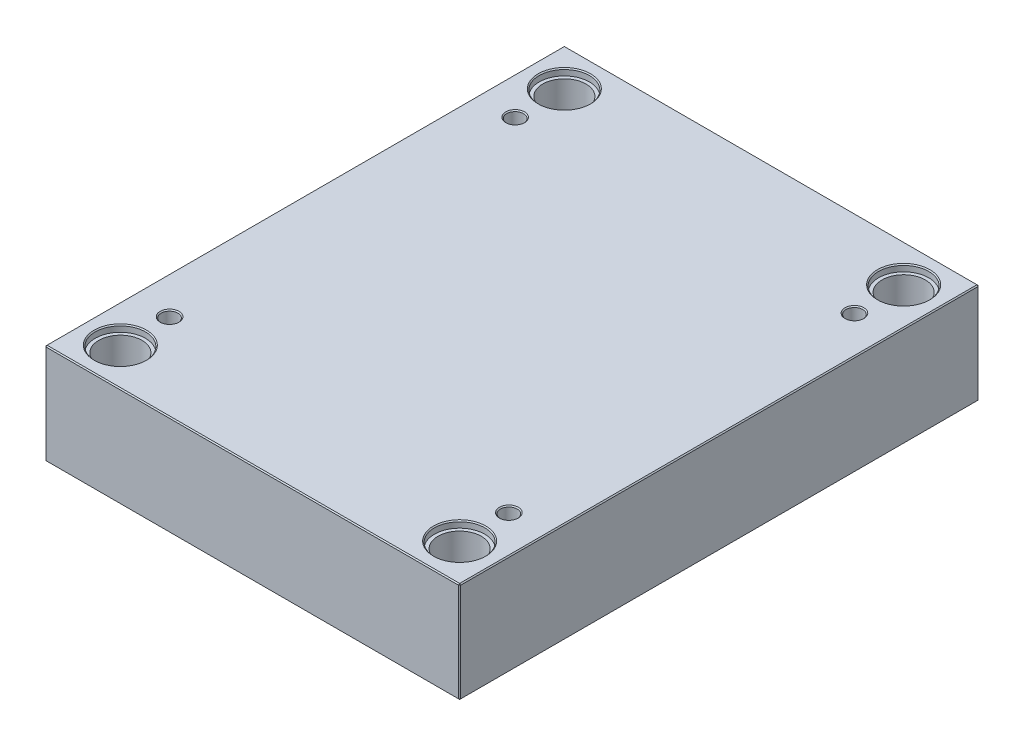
ISO-10303-21;
HEADER;
FILE_DESCRIPTION(('STEP AP214'),'2;1');
FILE_NAME('part.step','',(''),(''),'','','');
FILE_SCHEMA(('AUTOMOTIVE_DESIGN { 1 0 10303 214 1 1 1 1 }'));
ENDSEC;
DATA;
#1=APPLICATION_CONTEXT('core data for automotive mechanical design processes');
#2=APPLICATION_PROTOCOL_DEFINITION('international standard','automotive_design',2000,#1);
#3=PRODUCT_CONTEXT('',#1,'mechanical');
#4=PRODUCT('Part','Part','',(#3));
#5=PRODUCT_RELATED_PRODUCT_CATEGORY('part','',(#4));
#6=PRODUCT_DEFINITION_FORMATION('','',#4);
#7=PRODUCT_DEFINITION_CONTEXT('part definition',#1,'design');
#8=PRODUCT_DEFINITION('design','',#6,#7);
#9=PRODUCT_DEFINITION_SHAPE('','',#8);
#10=(LENGTH_UNIT() NAMED_UNIT(*) SI_UNIT(.MILLI.,.METRE.));
#11=(NAMED_UNIT(*) PLANE_ANGLE_UNIT() SI_UNIT($,.RADIAN.));
#12=(NAMED_UNIT(*) SI_UNIT($,.STERADIAN.) SOLID_ANGLE_UNIT());
#13=UNCERTAINTY_MEASURE_WITH_UNIT(LENGTH_MEASURE(1.E-05),#10,'distance_accuracy_value','');
#14=(GEOMETRIC_REPRESENTATION_CONTEXT(3) GLOBAL_UNCERTAINTY_ASSIGNED_CONTEXT((#13)) GLOBAL_UNIT_ASSIGNED_CONTEXT((#10,
#11,#12)) REPRESENTATION_CONTEXT('',''));
#15=CARTESIAN_POINT('',(0.,0.,0.));
#16=DIRECTION('',(0.,0.,1.));
#17=DIRECTION('',(1.,0.,0.));
#18=AXIS2_PLACEMENT_3D('',#15,#16,#17);
#19=CARTESIAN_POINT('',(-162.,0.,-212.));
#20=DIRECTION('',(0.,1.,0.));
#21=DIRECTION('',(0.,0.,1.));
#22=AXIS2_PLACEMENT_3D('',#19,#20,#21);
#23=CYLINDRICAL_SURFACE('',#22,20.65);
#24=CARTESIAN_POINT('',(-162.,0.999999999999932,-212.));
#25=DIRECTION('',(0.,1.,0.));
#26=DIRECTION('',(0.,0.,1.));
#27=AXIS2_PLACEMENT_3D('',#24,#25,#26);
#28=CIRCLE('',#27,20.65);
#29=CARTESIAN_POINT('',(-162.,0.999999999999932,-191.35));
#30=VERTEX_POINT('',#29);
#31=EDGE_CURVE('E472',#30,#30,#28,.F.);
#32=ORIENTED_EDGE('',*,*,#31,.T.);
#33=EDGE_LOOP('',(#32));
#34=FACE_BOUND('',#33,.T.);
#35=CARTESIAN_POINT('',(-162.,89.7,-212.));
#36=DIRECTION('',(0.,1.,0.));
#37=DIRECTION('',(0.,0.,1.));
#38=AXIS2_PLACEMENT_3D('',#35,#36,#37);
#39=CIRCLE('',#38,20.65);
#40=CARTESIAN_POINT('',(-162.,89.7,-191.35));
#41=VERTEX_POINT('',#40);
#42=EDGE_CURVE('E221',#41,#41,#39,.F.);
#43=ORIENTED_EDGE('',*,*,#42,.F.);
#44=EDGE_LOOP('',(#43));
#45=FACE_BOUND('',#44,.T.);
#46=ADVANCED_FACE('F16',(#34,#45),#23,.F.);
#47=CARTESIAN_POINT('',(162.,0.,-212.));
#48=DIRECTION('',(0.,1.,0.));
#49=DIRECTION('',(0.,0.,1.));
#50=AXIS2_PLACEMENT_3D('',#47,#48,#49);
#51=CYLINDRICAL_SURFACE('',#50,20.65);
#52=CARTESIAN_POINT('',(162.,0.999999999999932,-212.));
#53=DIRECTION('',(0.,1.,0.));
#54=DIRECTION('',(0.,0.,1.));
#55=AXIS2_PLACEMENT_3D('',#52,#53,#54);
#56=CIRCLE('',#55,20.65);
#57=CARTESIAN_POINT('',(162.,0.999999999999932,-191.35));
#58=VERTEX_POINT('',#57);
#59=EDGE_CURVE('E474',#58,#58,#56,.F.);
#60=ORIENTED_EDGE('',*,*,#59,.T.);
#61=EDGE_LOOP('',(#60));
#62=FACE_BOUND('',#61,.T.);
#63=CARTESIAN_POINT('',(162.,89.7,-212.));
#64=DIRECTION('',(0.,1.,0.));
#65=DIRECTION('',(0.,0.,1.));
#66=AXIS2_PLACEMENT_3D('',#63,#64,#65);
#67=CIRCLE('',#66,20.65);
#68=CARTESIAN_POINT('',(162.,89.7,-191.35));
#69=VERTEX_POINT('',#68);
#70=EDGE_CURVE('E218',#69,#69,#67,.F.);
#71=ORIENTED_EDGE('',*,*,#70,.F.);
#72=EDGE_LOOP('',(#71));
#73=FACE_BOUND('',#72,.T.);
#74=ADVANCED_FACE('F263',(#62,#73),#51,.F.);
#75=CARTESIAN_POINT('',(162.,0.,212.));
#76=DIRECTION('',(0.,1.,0.));
#77=DIRECTION('',(0.,0.,1.));
#78=AXIS2_PLACEMENT_3D('',#75,#76,#77);
#79=CYLINDRICAL_SURFACE('',#78,20.65);
#80=CARTESIAN_POINT('',(162.,0.999999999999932,212.));
#81=DIRECTION('',(0.,1.,0.));
#82=DIRECTION('',(0.,0.,1.));
#83=AXIS2_PLACEMENT_3D('',#80,#81,#82);
#84=CIRCLE('',#83,20.65);
#85=CARTESIAN_POINT('',(162.,0.999999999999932,232.65));
#86=VERTEX_POINT('',#85);
#87=EDGE_CURVE('E477',#86,#86,#84,.F.);
#88=ORIENTED_EDGE('',*,*,#87,.T.);
#89=EDGE_LOOP('',(#88));
#90=FACE_BOUND('',#89,.T.);
#91=CARTESIAN_POINT('',(162.,89.7,212.));
#92=DIRECTION('',(0.,1.,0.));
#93=DIRECTION('',(0.,0.,1.));
#94=AXIS2_PLACEMENT_3D('',#91,#92,#93);
#95=CIRCLE('',#94,20.65);
#96=CARTESIAN_POINT('',(162.,89.7,232.65));
#97=VERTEX_POINT('',#96);
#98=EDGE_CURVE('E214',#97,#97,#95,.F.);
#99=ORIENTED_EDGE('',*,*,#98,.F.);
#100=EDGE_LOOP('',(#99));
#101=FACE_BOUND('',#100,.T.);
#102=ADVANCED_FACE('F270',(#90,#101),#79,.F.);
#103=CARTESIAN_POINT('',(-162.,0.,212.));
#104=DIRECTION('',(0.,1.,0.));
#105=DIRECTION('',(0.,0.,1.));
#106=AXIS2_PLACEMENT_3D('',#103,#104,#105);
#107=CYLINDRICAL_SURFACE('',#106,20.65);
#108=CARTESIAN_POINT('',(-162.,0.999999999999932,212.));
#109=DIRECTION('',(0.,1.,0.));
#110=DIRECTION('',(0.,0.,1.));
#111=AXIS2_PLACEMENT_3D('',#108,#109,#110);
#112=CIRCLE('',#111,20.65);
#113=CARTESIAN_POINT('',(-162.,0.999999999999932,232.65));
#114=VERTEX_POINT('',#113);
#115=EDGE_CURVE('E480',#114,#114,#112,.F.);
#116=ORIENTED_EDGE('',*,*,#115,.T.);
#117=EDGE_LOOP('',(#116));
#118=FACE_BOUND('',#117,.T.);
#119=CARTESIAN_POINT('',(-162.,89.7,212.));
#120=DIRECTION('',(0.,1.,0.));
#121=DIRECTION('',(0.,0.,1.));
#122=AXIS2_PLACEMENT_3D('',#119,#120,#121);
#123=CIRCLE('',#122,20.65);
#124=CARTESIAN_POINT('',(-162.,89.7,232.65));
#125=VERTEX_POINT('',#124);
#126=EDGE_CURVE('E211',#125,#125,#123,.F.);
#127=ORIENTED_EDGE('',*,*,#126,.F.);
#128=EDGE_LOOP('',(#127));
#129=FACE_BOUND('',#128,.T.);
#130=ADVANCED_FACE('F277',(#118,#129),#107,.F.);
#131=CARTESIAN_POINT('',(-198.,96.,248.));
#132=DIRECTION('',(1.,0.,0.));
#133=DIRECTION('',(0.,0.,-1.));
#134=AXIS2_PLACEMENT_3D('',#131,#132,#133);
#135=PLANE('',#134);
#136=DIRECTION('',(0.,-1.,0.));
#137=VECTOR('',#136,1.);
#138=CARTESIAN_POINT('',(-198.,96.,-247.));
#139=LINE('',#138,#137);
#140=CARTESIAN_POINT('',(-198.,95.,-247.));
#141=VERTEX_POINT('',#140);
#142=CARTESIAN_POINT('',(-198.,1.,-247.));
#143=VERTEX_POINT('',#142);
#144=EDGE_CURVE('E487',#141,#143,#139,.T.);
#145=ORIENTED_EDGE('',*,*,#144,.T.);
#146=DIRECTION('',(0.,0.,1.));
#147=VECTOR('',#146,1.);
#148=CARTESIAN_POINT('',(-198.,1.,248.));
#149=LINE('',#148,#147);
#150=CARTESIAN_POINT('',(-198.,1.,247.));
#151=VERTEX_POINT('',#150);
#152=EDGE_CURVE('E490',#143,#151,#149,.T.);
#153=ORIENTED_EDGE('',*,*,#152,.T.);
#154=DIRECTION('',(0.,1.,0.));
#155=VECTOR('',#154,1.);
#156=CARTESIAN_POINT('',(-198.,96.,247.));
#157=LINE('',#156,#155);
#158=CARTESIAN_POINT('',(-198.,95.,247.));
#159=VERTEX_POINT('',#158);
#160=EDGE_CURVE('E485',#151,#159,#157,.T.);
#161=ORIENTED_EDGE('',*,*,#160,.T.);
#162=DIRECTION('',(0.,0.,-1.));
#163=VECTOR('',#162,1.);
#164=CARTESIAN_POINT('',(-198.,95.,-248.));
#165=LINE('',#164,#163);
#166=EDGE_CURVE('E483',#159,#141,#165,.T.);
#167=ORIENTED_EDGE('',*,*,#166,.T.);
#168=EDGE_LOOP('',(#145,#153,#161,#167));
#169=FACE_BOUND('',#168,.T.);
#170=ADVANCED_FACE('F298',(#169),#135,.F.);
#171=CARTESIAN_POINT('',(198.,96.,248.));
#172=DIRECTION('',(0.,0.,-1.));
#173=DIRECTION('',(-1.,0.,0.));
#174=AXIS2_PLACEMENT_3D('',#171,#172,#173);
#175=PLANE('',#174);
#176=DIRECTION('',(-1.,0.,0.));
#177=VECTOR('',#176,1.);
#178=CARTESIAN_POINT('',(-198.,95.,248.));
#179=LINE('',#178,#177);
#180=CARTESIAN_POINT('',(197.,95.,248.));
#181=VERTEX_POINT('',#180);
#182=CARTESIAN_POINT('',(-197.,95.,248.));
#183=VERTEX_POINT('',#182);
#184=EDGE_CURVE('E509',#181,#183,#179,.T.);
#185=ORIENTED_EDGE('',*,*,#184,.T.);
#186=DIRECTION('',(0.,-1.,0.));
#187=VECTOR('',#186,1.);
#188=CARTESIAN_POINT('',(-197.,96.,248.));
#189=LINE('',#188,#187);
#190=CARTESIAN_POINT('',(-197.,0.999999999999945,248.));
#191=VERTEX_POINT('',#190);
#192=EDGE_CURVE('E515',#183,#191,#189,.T.);
#193=ORIENTED_EDGE('',*,*,#192,.T.);
#194=DIRECTION('',(1.,0.,0.));
#195=VECTOR('',#194,1.);
#196=CARTESIAN_POINT('',(198.,0.999999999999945,248.));
#197=LINE('',#196,#195);
#198=CARTESIAN_POINT('',(197.,0.999999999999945,248.));
#199=VERTEX_POINT('',#198);
#200=EDGE_CURVE('E513',#191,#199,#197,.T.);
#201=ORIENTED_EDGE('',*,*,#200,.T.);
#202=DIRECTION('',(0.,1.,0.));
#203=VECTOR('',#202,1.);
#204=CARTESIAN_POINT('',(197.,96.,248.));
#205=LINE('',#204,#203);
#206=EDGE_CURVE('E511',#199,#181,#205,.T.);
#207=ORIENTED_EDGE('',*,*,#206,.T.);
#208=EDGE_LOOP('',(#185,#193,#201,#207));
#209=FACE_BOUND('',#208,.T.);
#210=ADVANCED_FACE('F294',(#209),#175,.F.);
#211=CARTESIAN_POINT('',(198.,96.,248.));
#212=DIRECTION('',(-1.,0.,0.));
#213=DIRECTION('',(0.,0.,1.));
#214=AXIS2_PLACEMENT_3D('',#211,#212,#213);
#215=PLANE('',#214);
#216=DIRECTION('',(0.,0.,-1.));
#217=VECTOR('',#216,1.);
#218=CARTESIAN_POINT('',(198.,0.999999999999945,248.));
#219=LINE('',#218,#217);
#220=CARTESIAN_POINT('',(198.,0.999999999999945,247.));
#221=VERTEX_POINT('',#220);
#222=CARTESIAN_POINT('',(198.,0.999999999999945,-247.));
#223=VERTEX_POINT('',#222);
#224=EDGE_CURVE('E504',#221,#223,#219,.T.);
#225=ORIENTED_EDGE('',*,*,#224,.T.);
#226=DIRECTION('',(0.,1.,0.));
#227=VECTOR('',#226,1.);
#228=CARTESIAN_POINT('',(198.,96.,-247.));
#229=LINE('',#228,#227);
#230=CARTESIAN_POINT('',(198.,95.,-247.));
#231=VERTEX_POINT('',#230);
#232=EDGE_CURVE('E506',#223,#231,#229,.T.);
#233=ORIENTED_EDGE('',*,*,#232,.T.);
#234=DIRECTION('',(0.,0.,1.));
#235=VECTOR('',#234,1.);
#236=CARTESIAN_POINT('',(198.,95.,248.));
#237=LINE('',#236,#235);
#238=CARTESIAN_POINT('',(198.,95.,247.));
#239=VERTEX_POINT('',#238);
#240=EDGE_CURVE('E500',#231,#239,#237,.T.);
#241=ORIENTED_EDGE('',*,*,#240,.T.);
#242=DIRECTION('',(0.,-1.,0.));
#243=VECTOR('',#242,1.);
#244=CARTESIAN_POINT('',(198.,96.,247.));
#245=LINE('',#244,#243);
#246=EDGE_CURVE('E502',#239,#221,#245,.T.);
#247=ORIENTED_EDGE('',*,*,#246,.T.);
#248=EDGE_LOOP('',(#225,#233,#241,#247));
#249=FACE_BOUND('',#248,.T.);
#250=ADVANCED_FACE('F290',(#249),#215,.F.);
#251=CARTESIAN_POINT('',(198.,96.,-248.));
#252=DIRECTION('',(0.,0.,1.));
#253=DIRECTION('',(1.,0.,0.));
#254=AXIS2_PLACEMENT_3D('',#251,#252,#253);
#255=PLANE('',#254);
#256=DIRECTION('',(0.,-1.,0.));
#257=VECTOR('',#256,1.);
#258=CARTESIAN_POINT('',(197.,96.,-248.));
#259=LINE('',#258,#257);
#260=CARTESIAN_POINT('',(197.,95.,-248.));
#261=VERTEX_POINT('',#260);
#262=CARTESIAN_POINT('',(197.,0.999999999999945,-248.));
#263=VERTEX_POINT('',#262);
#264=EDGE_CURVE('E494',#261,#263,#259,.T.);
#265=ORIENTED_EDGE('',*,*,#264,.T.);
#266=DIRECTION('',(-1.,0.,0.));
#267=VECTOR('',#266,1.);
#268=CARTESIAN_POINT('',(198.,0.999999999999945,-248.));
#269=LINE('',#268,#267);
#270=CARTESIAN_POINT('',(-197.,0.999999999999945,-248.));
#271=VERTEX_POINT('',#270);
#272=EDGE_CURVE('E138',#263,#271,#269,.T.);
#273=ORIENTED_EDGE('',*,*,#272,.T.);
#274=DIRECTION('',(0.,1.,0.));
#275=VECTOR('',#274,1.);
#276=CARTESIAN_POINT('',(-197.,96.,-248.));
#277=LINE('',#276,#275);
#278=CARTESIAN_POINT('',(-197.,95.,-248.));
#279=VERTEX_POINT('',#278);
#280=EDGE_CURVE('E496',#271,#279,#277,.T.);
#281=ORIENTED_EDGE('',*,*,#280,.T.);
#282=DIRECTION('',(1.,0.,0.));
#283=VECTOR('',#282,1.);
#284=CARTESIAN_POINT('',(198.,95.,-248.));
#285=LINE('',#284,#283);
#286=EDGE_CURVE('E492',#279,#261,#285,.T.);
#287=ORIENTED_EDGE('',*,*,#286,.T.);
#288=EDGE_LOOP('',(#265,#273,#281,#287));
#289=FACE_BOUND('',#288,.T.);
#290=ADVANCED_FACE('F282',(#289),#255,.F.);
#291=CARTESIAN_POINT('',(0.,96.,0.));
#292=DIRECTION('',(0.,1.,0.));
#293=DIRECTION('',(0.,0.,1.));
#294=AXIS2_PLACEMENT_3D('',#291,#292,#293);
#295=PLANE('',#294);
#296=CARTESIAN_POINT('',(162.,96.,212.));
#297=DIRECTION('',(0.,1.,0.));
#298=DIRECTION('',(0.,0.,1.));
#299=AXIS2_PLACEMENT_3D('',#296,#297,#298);
#300=CIRCLE('',#299,25.);
#301=CARTESIAN_POINT('',(162.,96.,237.));
#302=VERTEX_POINT('',#301);
#303=EDGE_CURVE('E236',#302,#302,#300,.F.);
#304=ORIENTED_EDGE('',*,*,#303,.T.);
#305=EDGE_LOOP('',(#304));
#306=FACE_BOUND('',#305,.T.);
#307=CARTESIAN_POINT('',(-162.,96.,212.));
#308=DIRECTION('',(0.,1.,0.));
#309=DIRECTION('',(0.,0.,1.));
#310=AXIS2_PLACEMENT_3D('',#307,#308,#309);
#311=CIRCLE('',#310,25.);
#312=CARTESIAN_POINT('',(-162.,96.,237.));
#313=VERTEX_POINT('',#312);
#314=EDGE_CURVE('E233',#313,#313,#311,.F.);
#315=ORIENTED_EDGE('',*,*,#314,.T.);
#316=EDGE_LOOP('',(#315));
#317=FACE_BOUND('',#316,.T.);
#318=CARTESIAN_POINT('',(162.,96.,-212.));
#319=DIRECTION('',(0.,1.,0.));
#320=DIRECTION('',(0.,0.,1.));
#321=AXIS2_PLACEMENT_3D('',#318,#319,#320);
#322=CIRCLE('',#321,25.);
#323=CARTESIAN_POINT('',(162.,96.,-187.));
#324=VERTEX_POINT('',#323);
#325=EDGE_CURVE('E230',#324,#324,#322,.F.);
#326=ORIENTED_EDGE('',*,*,#325,.T.);
#327=EDGE_LOOP('',(#326));
#328=FACE_BOUND('',#327,.T.);
#329=CARTESIAN_POINT('',(-162.,96.,-212.));
#330=DIRECTION('',(0.,1.,0.));
#331=DIRECTION('',(0.,0.,1.));
#332=AXIS2_PLACEMENT_3D('',#329,#330,#331);
#333=CIRCLE('',#332,25.);
#334=CARTESIAN_POINT('',(-162.,96.,-187.));
#335=VERTEX_POINT('',#334);
#336=EDGE_CURVE('E227',#335,#335,#333,.F.);
#337=ORIENTED_EDGE('',*,*,#336,.T.);
#338=EDGE_LOOP('',(#337));
#339=FACE_BOUND('',#338,.T.);
#340=CARTESIAN_POINT('',(-162.,96.,165.));
#341=DIRECTION('',(0.,1.,0.));
#342=DIRECTION('',(0.,0.,1.));
#343=AXIS2_PLACEMENT_3D('',#340,#341,#342);
#344=CIRCLE('',#343,9.);
#345=CARTESIAN_POINT('',(-162.,96.,174.));
#346=VERTEX_POINT('',#345);
#347=EDGE_CURVE('E198',#346,#346,#344,.F.);
#348=ORIENTED_EDGE('',*,*,#347,.T.);
#349=EDGE_LOOP('',(#348));
#350=FACE_BOUND('',#349,.T.);
#351=CARTESIAN_POINT('',(162.,96.,165.));
#352=DIRECTION('',(0.,1.,0.));
#353=DIRECTION('',(0.,0.,1.));
#354=AXIS2_PLACEMENT_3D('',#351,#352,#353);
#355=CIRCLE('',#354,9.);
#356=CARTESIAN_POINT('',(162.,96.,174.));
#357=VERTEX_POINT('',#356);
#358=EDGE_CURVE('E195',#357,#357,#355,.F.);
#359=ORIENTED_EDGE('',*,*,#358,.T.);
#360=EDGE_LOOP('',(#359));
#361=FACE_BOUND('',#360,.T.);
#362=CARTESIAN_POINT('',(162.,96.,-165.));
#363=DIRECTION('',(0.,1.,0.));
#364=DIRECTION('',(0.,0.,1.));
#365=AXIS2_PLACEMENT_3D('',#362,#363,#364);
#366=CIRCLE('',#365,9.);
#367=CARTESIAN_POINT('',(162.,96.,-156.));
#368=VERTEX_POINT('',#367);
#369=EDGE_CURVE('E192',#368,#368,#366,.F.);
#370=ORIENTED_EDGE('',*,*,#369,.T.);
#371=EDGE_LOOP('',(#370));
#372=FACE_BOUND('',#371,.T.);
#373=CARTESIAN_POINT('',(-162.,96.,-165.));
#374=DIRECTION('',(0.,1.,0.));
#375=DIRECTION('',(0.,0.,1.));
#376=AXIS2_PLACEMENT_3D('',#373,#374,#375);
#377=CIRCLE('',#376,9.);
#378=CARTESIAN_POINT('',(-162.,96.,-156.));
#379=VERTEX_POINT('',#378);
#380=EDGE_CURVE('E188',#379,#379,#377,.F.);
#381=ORIENTED_EDGE('',*,*,#380,.T.);
#382=EDGE_LOOP('',(#381));
#383=FACE_BOUND('',#382,.T.);
#384=DIRECTION('',(0.,0.,-1.));
#385=VECTOR('',#384,1.);
#386=CARTESIAN_POINT('',(197.,96.,-248.));
#387=LINE('',#386,#385);
#388=CARTESIAN_POINT('',(197.,96.,247.));
#389=VERTEX_POINT('',#388);
#390=CARTESIAN_POINT('',(197.,96.,-247.));
#391=VERTEX_POINT('',#390);
#392=EDGE_CURVE('E31',#389,#391,#387,.T.);
#393=ORIENTED_EDGE('',*,*,#392,.T.);
#394=DIRECTION('',(-1.,0.,0.));
#395=VECTOR('',#394,1.);
#396=CARTESIAN_POINT('',(-198.,96.,-247.));
#397=LINE('',#396,#395);
#398=CARTESIAN_POINT('',(-197.,96.,-247.));
#399=VERTEX_POINT('',#398);
#400=EDGE_CURVE('E189',#391,#399,#397,.T.);
#401=ORIENTED_EDGE('',*,*,#400,.T.);
#402=DIRECTION('',(0.,0.,1.));
#403=VECTOR('',#402,1.);
#404=CARTESIAN_POINT('',(-197.,96.,248.));
#405=LINE('',#404,#403);
#406=CARTESIAN_POINT('',(-197.,96.,247.));
#407=VERTEX_POINT('',#406);
#408=EDGE_CURVE('E518',#399,#407,#405,.T.);
#409=ORIENTED_EDGE('',*,*,#408,.T.);
#410=DIRECTION('',(1.,0.,0.));
#411=VECTOR('',#410,1.);
#412=CARTESIAN_POINT('',(198.,96.,247.));
#413=LINE('',#412,#411);
#414=EDGE_CURVE('E36',#407,#389,#413,.T.);
#415=ORIENTED_EDGE('',*,*,#414,.T.);
#416=EDGE_LOOP('',(#393,#401,#409,#415));
#417=FACE_BOUND('',#416,.T.);
#418=ADVANCED_FACE('F279',(#306,#317,#328,#339,#350,#361,#372,#383,#417),#295,.T.);
#419=CARTESIAN_POINT('',(0.,0.,0.));
#420=DIRECTION('',(0.,1.,0.));
#421=DIRECTION('',(0.,0.,1.));
#422=AXIS2_PLACEMENT_3D('',#419,#420,#421);
#423=PLANE('',#422);
#424=CARTESIAN_POINT('',(-162.,0.,-212.));
#425=DIRECTION('',(0.,1.,0.));
#426=DIRECTION('',(0.,0.,1.));
#427=AXIS2_PLACEMENT_3D('',#424,#425,#426);
#428=CIRCLE('',#427,21.65);
#429=CARTESIAN_POINT('',(-162.,0.,-190.35));
#430=VERTEX_POINT('',#429);
#431=EDGE_CURVE('E469',#430,#430,#428,.T.);
#432=ORIENTED_EDGE('',*,*,#431,.T.);
#433=EDGE_LOOP('',(#432));
#434=FACE_BOUND('',#433,.T.);
#435=CARTESIAN_POINT('',(162.,0.,-212.));
#436=DIRECTION('',(0.,1.,0.));
#437=DIRECTION('',(0.,0.,1.));
#438=AXIS2_PLACEMENT_3D('',#435,#436,#437);
#439=CIRCLE('',#438,21.65);
#440=CARTESIAN_POINT('',(162.,0.,-190.35));
#441=VERTEX_POINT('',#440);
#442=EDGE_CURVE('E466',#441,#441,#439,.T.);
#443=ORIENTED_EDGE('',*,*,#442,.T.);
#444=EDGE_LOOP('',(#443));
#445=FACE_BOUND('',#444,.T.);
#446=CARTESIAN_POINT('',(162.,0.,212.));
#447=DIRECTION('',(0.,1.,0.));
#448=DIRECTION('',(0.,0.,1.));
#449=AXIS2_PLACEMENT_3D('',#446,#447,#448);
#450=CIRCLE('',#449,21.65);
#451=CARTESIAN_POINT('',(162.,0.,233.65));
#452=VERTEX_POINT('',#451);
#453=EDGE_CURVE('E463',#452,#452,#450,.T.);
#454=ORIENTED_EDGE('',*,*,#453,.T.);
#455=EDGE_LOOP('',(#454));
#456=FACE_BOUND('',#455,.T.);
#457=CARTESIAN_POINT('',(-162.,0.,212.));
#458=DIRECTION('',(0.,1.,0.));
#459=DIRECTION('',(0.,0.,1.));
#460=AXIS2_PLACEMENT_3D('',#457,#458,#459);
#461=CIRCLE('',#460,21.65);
#462=CARTESIAN_POINT('',(-162.,0.,233.65));
#463=VERTEX_POINT('',#462);
#464=EDGE_CURVE('E460',#463,#463,#461,.T.);
#465=ORIENTED_EDGE('',*,*,#464,.T.);
#466=EDGE_LOOP('',(#465));
#467=FACE_BOUND('',#466,.T.);
#468=DIRECTION('',(0.,0.,1.));
#469=VECTOR('',#468,1.);
#470=CARTESIAN_POINT('',(197.,0.,0.));
#471=LINE('',#470,#469);
#472=CARTESIAN_POINT('',(197.,0.,-247.));
#473=VERTEX_POINT('',#472);
#474=CARTESIAN_POINT('',(197.,0.,247.));
#475=VERTEX_POINT('',#474);
#476=EDGE_CURVE('E108',#473,#475,#471,.T.);
#477=ORIENTED_EDGE('',*,*,#476,.T.);
#478=DIRECTION('',(-1.,0.,0.));
#479=VECTOR('',#478,1.);
#480=CARTESIAN_POINT('',(0.,0.,247.));
#481=LINE('',#480,#479);
#482=CARTESIAN_POINT('',(-197.,0.,247.));
#483=VERTEX_POINT('',#482);
#484=EDGE_CURVE('E458',#475,#483,#481,.T.);
#485=ORIENTED_EDGE('',*,*,#484,.T.);
#486=DIRECTION('',(0.,0.,-1.));
#487=VECTOR('',#486,1.);
#488=CARTESIAN_POINT('',(-197.,0.,0.));
#489=LINE('',#488,#487);
#490=CARTESIAN_POINT('',(-197.,0.,-247.));
#491=VERTEX_POINT('',#490);
#492=EDGE_CURVE('E110',#483,#491,#489,.T.);
#493=ORIENTED_EDGE('',*,*,#492,.T.);
#494=DIRECTION('',(1.,0.,0.));
#495=VECTOR('',#494,1.);
#496=CARTESIAN_POINT('',(0.,0.,-247.));
#497=LINE('',#496,#495);
#498=EDGE_CURVE('E104',#491,#473,#497,.T.);
#499=ORIENTED_EDGE('',*,*,#498,.T.);
#500=EDGE_LOOP('',(#477,#485,#493,#499));
#501=FACE_BOUND('',#500,.T.);
#502=ADVANCED_FACE('F106',(#434,#445,#456,#467,#501),#423,.F.);
#503=CARTESIAN_POINT('',(-162.,0.,-212.));
#504=DIRECTION('',(0.,-1.,0.));
#505=DIRECTION('',(0.,0.,-1.));
#506=AXIS2_PLACEMENT_3D('',#503,#504,#505);
#507=CONICAL_SURFACE('',#506,21.65,0.785398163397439);
#508=ORIENTED_EDGE('',*,*,#31,.F.);
#509=EDGE_LOOP('',(#508));
#510=FACE_BOUND('',#509,.T.);
#511=ORIENTED_EDGE('',*,*,#431,.F.);
#512=EDGE_LOOP('',(#511));
#513=FACE_BOUND('',#512,.T.);
#514=ADVANCED_FACE('F286',(#510,#513),#507,.F.);
#515=CARTESIAN_POINT('',(162.,0.,-212.));
#516=DIRECTION('',(0.,-1.,0.));
#517=DIRECTION('',(0.,0.,-1.));
#518=AXIS2_PLACEMENT_3D('',#515,#516,#517);
#519=CONICAL_SURFACE('',#518,21.65,0.785398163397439);
#520=ORIENTED_EDGE('',*,*,#59,.F.);
#521=EDGE_LOOP('',(#520));
#522=FACE_BOUND('',#521,.T.);
#523=ORIENTED_EDGE('',*,*,#442,.F.);
#524=EDGE_LOOP('',(#523));
#525=FACE_BOUND('',#524,.T.);
#526=ADVANCED_FACE('F305',(#522,#525),#519,.F.);
#527=CARTESIAN_POINT('',(162.,0.,212.));
#528=DIRECTION('',(0.,-1.,0.));
#529=DIRECTION('',(0.,0.,-1.));
#530=AXIS2_PLACEMENT_3D('',#527,#528,#529);
#531=CONICAL_SURFACE('',#530,21.65,0.785398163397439);
#532=ORIENTED_EDGE('',*,*,#87,.F.);
#533=EDGE_LOOP('',(#532));
#534=FACE_BOUND('',#533,.T.);
#535=ORIENTED_EDGE('',*,*,#453,.F.);
#536=EDGE_LOOP('',(#535));
#537=FACE_BOUND('',#536,.T.);
#538=ADVANCED_FACE('F309',(#534,#537),#531,.F.);
#539=CARTESIAN_POINT('',(-162.,0.,212.));
#540=DIRECTION('',(0.,-1.,0.));
#541=DIRECTION('',(0.,0.,-1.));
#542=AXIS2_PLACEMENT_3D('',#539,#540,#541);
#543=CONICAL_SURFACE('',#542,21.65,0.785398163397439);
#544=ORIENTED_EDGE('',*,*,#115,.F.);
#545=EDGE_LOOP('',(#544));
#546=FACE_BOUND('',#545,.T.);
#547=ORIENTED_EDGE('',*,*,#464,.F.);
#548=EDGE_LOOP('',(#547));
#549=FACE_BOUND('',#548,.T.);
#550=ADVANCED_FACE('F313',(#546,#549),#543,.F.);
#551=CARTESIAN_POINT('',(198.,96.,247.));
#552=DIRECTION('',(-0.707106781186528,0.,-0.707106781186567));
#553=DIRECTION('',(0.,-1.,0.));
#554=AXIS2_PLACEMENT_3D('',#551,#552,#553);
#555=PLANE('',#554);
#556=DIRECTION('',(-0.707106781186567,0.,0.707106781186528));
#557=VECTOR('',#556,1.);
#558=CARTESIAN_POINT('',(197.,95.,248.));
#559=LINE('',#558,#557);
#560=EDGE_CURVE('E126',#181,#239,#559,.F.);
#561=ORIENTED_EDGE('',*,*,#560,.F.);
#562=ORIENTED_EDGE('',*,*,#206,.F.);
#563=DIRECTION('',(0.707106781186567,0.,-0.707106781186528));
#564=VECTOR('',#563,1.);
#565=CARTESIAN_POINT('',(197.,0.999999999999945,248.));
#566=LINE('',#565,#564);
#567=EDGE_CURVE('E180',#221,#199,#566,.F.);
#568=ORIENTED_EDGE('',*,*,#567,.F.);
#569=ORIENTED_EDGE('',*,*,#246,.F.);
#570=EDGE_LOOP('',(#561,#562,#568,#569));
#571=FACE_BOUND('',#570,.T.);
#572=ADVANCED_FACE('F317',(#571),#555,.F.);
#573=CARTESIAN_POINT('',(197.,95.,248.));
#574=DIRECTION('',(0.577350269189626,0.577350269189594,0.577350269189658));
#575=DIRECTION('',(0.707106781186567,0.,-0.707106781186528));
#576=AXIS2_PLACEMENT_3D('',#573,#574,#575);
#577=PLANE('',#576);
#578=DIRECTION('',(0.,-0.707106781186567,0.707106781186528));
#579=VECTOR('',#578,1.);
#580=CARTESIAN_POINT('',(197.,95.,248.));
#581=LINE('',#580,#579);
#582=EDGE_CURVE('E175',#181,#389,#581,.F.);
#583=ORIENTED_EDGE('',*,*,#582,.F.);
#584=ORIENTED_EDGE('',*,*,#560,.T.);
#585=DIRECTION('',(-0.707106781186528,0.707106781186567,0.));
#586=VECTOR('',#585,1.);
#587=CARTESIAN_POINT('',(197.5,95.5,247.));
#588=LINE('',#587,#586);
#589=EDGE_CURVE('E177',#389,#239,#588,.F.);
#590=ORIENTED_EDGE('',*,*,#589,.F.);
#591=EDGE_LOOP('',(#583,#584,#590));
#592=FACE_BOUND('',#591,.T.);
#593=ADVANCED_FACE('F385',(#592),#577,.T.);
#594=CARTESIAN_POINT('',(197.,0.999999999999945,248.));
#595=DIRECTION('',(0.577350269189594,-0.577350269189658,0.577350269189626));
#596=DIRECTION('',(0.,-0.707106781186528,-0.707106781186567));
#597=AXIS2_PLACEMENT_3D('',#594,#595,#596);
#598=PLANE('',#597);
#599=DIRECTION('',(-0.707106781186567,-0.707106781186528,0.));
#600=VECTOR('',#599,1.);
#601=CARTESIAN_POINT('',(197.5,0.499999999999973,247.));
#602=LINE('',#601,#600);
#603=EDGE_CURVE('E124',#221,#475,#602,.T.);
#604=ORIENTED_EDGE('',*,*,#603,.F.);
#605=ORIENTED_EDGE('',*,*,#567,.T.);
#606=DIRECTION('',(0.,0.707106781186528,0.707106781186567));
#607=VECTOR('',#606,1.);
#608=CARTESIAN_POINT('',(197.,0.999999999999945,248.));
#609=LINE('',#608,#607);
#610=EDGE_CURVE('E172',#475,#199,#609,.T.);
#611=ORIENTED_EDGE('',*,*,#610,.F.);
#612=EDGE_LOOP('',(#604,#605,#611));
#613=FACE_BOUND('',#612,.T.);
#614=ADVANCED_FACE('F381',(#613),#598,.T.);
#615=CARTESIAN_POINT('',(197.,96.,0.));
#616=DIRECTION('',(0.707106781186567,0.707106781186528,0.));
#617=DIRECTION('',(0.,0.,1.));
#618=AXIS2_PLACEMENT_3D('',#615,#616,#617);
#619=PLANE('',#618);
#620=ORIENTED_EDGE('',*,*,#589,.T.);
#621=ORIENTED_EDGE('',*,*,#240,.F.);
#622=DIRECTION('',(0.707106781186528,-0.707106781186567,0.));
#623=VECTOR('',#622,1.);
#624=CARTESIAN_POINT('',(198.,95.,-247.));
#625=LINE('',#624,#623);
#626=EDGE_CURVE('E166',#391,#231,#625,.T.);
#627=ORIENTED_EDGE('',*,*,#626,.F.);
#628=ORIENTED_EDGE('',*,*,#392,.F.);
#629=EDGE_LOOP('',(#620,#621,#627,#628));
#630=FACE_BOUND('',#629,.T.);
#631=ADVANCED_FACE('F377',(#630),#619,.T.);
#632=CARTESIAN_POINT('',(0.,96.,247.));
#633=DIRECTION('',(0.,0.707106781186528,0.707106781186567));
#634=DIRECTION('',(-1.,0.,0.));
#635=AXIS2_PLACEMENT_3D('',#632,#633,#634);
#636=PLANE('',#635);
#637=ORIENTED_EDGE('',*,*,#582,.T.);
#638=ORIENTED_EDGE('',*,*,#414,.F.);
#639=DIRECTION('',(0.,0.707106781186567,-0.707106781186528));
#640=VECTOR('',#639,1.);
#641=CARTESIAN_POINT('',(-197.,95.5,247.5));
#642=LINE('',#641,#640);
#643=EDGE_CURVE('E163',#183,#407,#642,.T.);
#644=ORIENTED_EDGE('',*,*,#643,.F.);
#645=ORIENTED_EDGE('',*,*,#184,.F.);
#646=EDGE_LOOP('',(#637,#638,#644,#645));
#647=FACE_BOUND('',#646,.T.);
#648=ADVANCED_FACE('F373',(#647),#636,.T.);
#649=CARTESIAN_POINT('',(-197.,96.,248.));
#650=DIRECTION('',(0.707106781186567,0.,-0.707106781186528));
#651=DIRECTION('',(0.,-1.,0.));
#652=AXIS2_PLACEMENT_3D('',#649,#650,#651);
#653=PLANE('',#652);
#654=DIRECTION('',(0.707106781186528,0.,0.707106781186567));
#655=VECTOR('',#654,1.);
#656=CARTESIAN_POINT('',(-197.,0.999999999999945,248.));
#657=LINE('',#656,#655);
#658=EDGE_CURVE('E157',#191,#151,#657,.F.);
#659=ORIENTED_EDGE('',*,*,#658,.F.);
#660=ORIENTED_EDGE('',*,*,#192,.F.);
#661=DIRECTION('',(-0.707106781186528,0.,-0.707106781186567));
#662=VECTOR('',#661,1.);
#663=CARTESIAN_POINT('',(-198.,95.,247.));
#664=LINE('',#663,#662);
#665=EDGE_CURVE('E160',#159,#183,#664,.F.);
#666=ORIENTED_EDGE('',*,*,#665,.F.);
#667=ORIENTED_EDGE('',*,*,#160,.F.);
#668=EDGE_LOOP('',(#659,#660,#666,#667));
#669=FACE_BOUND('',#668,.T.);
#670=ADVANCED_FACE('F369',(#669),#653,.F.);
#671=CARTESIAN_POINT('',(198.,0.999999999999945,248.));
#672=DIRECTION('',(0.,0.707106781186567,-0.707106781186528));
#673=DIRECTION('',(1.,0.,0.));
#674=AXIS2_PLACEMENT_3D('',#671,#672,#673);
#675=PLANE('',#674);
#676=ORIENTED_EDGE('',*,*,#610,.T.);
#677=ORIENTED_EDGE('',*,*,#200,.F.);
#678=DIRECTION('',(0.,-0.707106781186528,-0.707106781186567));
#679=VECTOR('',#678,1.);
#680=CARTESIAN_POINT('',(-197.,0.999999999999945,248.));
#681=LINE('',#680,#679);
#682=EDGE_CURVE('E135',#483,#191,#681,.F.);
#683=ORIENTED_EDGE('',*,*,#682,.F.);
#684=ORIENTED_EDGE('',*,*,#484,.F.);
#685=EDGE_LOOP('',(#676,#677,#683,#684));
#686=FACE_BOUND('',#685,.T.);
#687=ADVANCED_FACE('F366',(#686),#675,.F.);
#688=CARTESIAN_POINT('',(198.,0.999999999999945,248.));
#689=DIRECTION('',(-0.707106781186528,0.707106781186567,0.));
#690=DIRECTION('',(0.,0.,-1.));
#691=AXIS2_PLACEMENT_3D('',#688,#689,#690);
#692=PLANE('',#691);
#693=ORIENTED_EDGE('',*,*,#603,.T.);
#694=ORIENTED_EDGE('',*,*,#476,.F.);
#695=DIRECTION('',(0.707106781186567,0.707106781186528,0.));
#696=VECTOR('',#695,1.);
#697=CARTESIAN_POINT('',(197.5,0.499999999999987,-247.));
#698=LINE('',#697,#696);
#699=EDGE_CURVE('E121',#223,#473,#698,.F.);
#700=ORIENTED_EDGE('',*,*,#699,.F.);
#701=ORIENTED_EDGE('',*,*,#224,.F.);
#702=EDGE_LOOP('',(#693,#694,#700,#701));
#703=FACE_BOUND('',#702,.T.);
#704=ADVANCED_FACE('F119',(#703),#692,.F.);
#705=CARTESIAN_POINT('',(197.,96.,-248.));
#706=DIRECTION('',(-0.707106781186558,0.,0.707106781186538));
#707=DIRECTION('',(0.,-1.,0.));
#708=AXIS2_PLACEMENT_3D('',#705,#706,#707);
#709=PLANE('',#708);
#710=DIRECTION('',(0.707106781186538,0.,0.707106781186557));
#711=VECTOR('',#710,1.);
#712=CARTESIAN_POINT('',(198.,95.,-247.));
#713=LINE('',#712,#711);
#714=EDGE_CURVE('E168',#231,#261,#713,.F.);
#715=ORIENTED_EDGE('',*,*,#714,.F.);
#716=ORIENTED_EDGE('',*,*,#232,.F.);
#717=DIRECTION('',(-0.707106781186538,0.,-0.707106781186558));
#718=VECTOR('',#717,1.);
#719=CARTESIAN_POINT('',(197.,0.999999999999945,-248.));
#720=LINE('',#719,#718);
#721=EDGE_CURVE('E134',#263,#223,#720,.F.);
#722=ORIENTED_EDGE('',*,*,#721,.F.);
#723=ORIENTED_EDGE('',*,*,#264,.F.);
#724=EDGE_LOOP('',(#715,#716,#722,#723));
#725=FACE_BOUND('',#724,.T.);
#726=ADVANCED_FACE('F359',(#725),#709,.F.);
#727=CARTESIAN_POINT('',(198.,95.,-247.));
#728=DIRECTION('',(0.577350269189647,0.577350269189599,-0.577350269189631));
#729=DIRECTION('',(-0.707106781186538,0.,-0.707106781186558));
#730=AXIS2_PLACEMENT_3D('',#727,#728,#729);
#731=PLANE('',#730);
#732=ORIENTED_EDGE('',*,*,#626,.T.);
#733=ORIENTED_EDGE('',*,*,#714,.T.);
#734=DIRECTION('',(0.,0.707106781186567,0.707106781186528));
#735=VECTOR('',#734,1.);
#736=CARTESIAN_POINT('',(197.,95.5,-247.5));
#737=LINE('',#736,#735);
#738=EDGE_CURVE('E152',#391,#261,#737,.F.);
#739=ORIENTED_EDGE('',*,*,#738,.F.);
#740=EDGE_LOOP('',(#732,#733,#739));
#741=FACE_BOUND('',#740,.T.);
#742=ADVANCED_FACE('F355',(#741),#731,.T.);
#743=CARTESIAN_POINT('',(-198.,95.,247.));
#744=DIRECTION('',(-0.577350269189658,0.577350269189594,0.577350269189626));
#745=DIRECTION('',(0.707106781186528,0.,0.707106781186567));
#746=AXIS2_PLACEMENT_3D('',#743,#744,#745);
#747=PLANE('',#746);
#748=ORIENTED_EDGE('',*,*,#665,.T.);
#749=ORIENTED_EDGE('',*,*,#643,.T.);
#750=DIRECTION('',(-0.707106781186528,-0.707106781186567,0.));
#751=VECTOR('',#750,1.);
#752=CARTESIAN_POINT('',(-198.,95.,247.));
#753=LINE('',#752,#751);
#754=EDGE_CURVE('E143',#159,#407,#753,.F.);
#755=ORIENTED_EDGE('',*,*,#754,.F.);
#756=EDGE_LOOP('',(#748,#749,#755));
#757=FACE_BOUND('',#756,.T.);
#758=ADVANCED_FACE('F351',(#757),#747,.T.);
#759=CARTESIAN_POINT('',(-197.,0.999999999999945,248.));
#760=DIRECTION('',(-0.577350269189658,-0.577350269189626,0.577350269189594));
#761=DIRECTION('',(0.707106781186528,-0.707106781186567,0.));
#762=AXIS2_PLACEMENT_3D('',#759,#760,#761);
#763=PLANE('',#762);
#764=ORIENTED_EDGE('',*,*,#682,.T.);
#765=ORIENTED_EDGE('',*,*,#658,.T.);
#766=DIRECTION('',(-0.707106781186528,0.707106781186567,0.));
#767=VECTOR('',#766,1.);
#768=CARTESIAN_POINT('',(-197.5,0.5,247.));
#769=LINE('',#768,#767);
#770=EDGE_CURVE('E139',#483,#151,#769,.T.);
#771=ORIENTED_EDGE('',*,*,#770,.F.);
#772=EDGE_LOOP('',(#764,#765,#771));
#773=FACE_BOUND('',#772,.T.);
#774=ADVANCED_FACE('F348',(#773),#763,.T.);
#775=CARTESIAN_POINT('',(197.,0.999999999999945,-248.));
#776=DIRECTION('',(0.577350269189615,-0.577350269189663,-0.577350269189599));
#777=DIRECTION('',(0.707106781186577,0.707106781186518,0.));
#778=AXIS2_PLACEMENT_3D('',#775,#776,#777);
#779=PLANE('',#778);
#780=ORIENTED_EDGE('',*,*,#721,.T.);
#781=ORIENTED_EDGE('',*,*,#699,.T.);
#782=DIRECTION('',(0.,-0.707106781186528,0.707106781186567));
#783=VECTOR('',#782,1.);
#784=CARTESIAN_POINT('',(197.,0.999999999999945,-248.));
#785=LINE('',#784,#783);
#786=EDGE_CURVE('E131',#263,#473,#785,.T.);
#787=ORIENTED_EDGE('',*,*,#786,.F.);
#788=EDGE_LOOP('',(#780,#781,#787));
#789=FACE_BOUND('',#788,.T.);
#790=ADVANCED_FACE('F130',(#789),#779,.T.);
#791=CARTESIAN_POINT('',(0.,96.,-247.));
#792=DIRECTION('',(0.,0.707106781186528,-0.707106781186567));
#793=DIRECTION('',(1.,0.,0.));
#794=AXIS2_PLACEMENT_3D('',#791,#792,#793);
#795=PLANE('',#794);
#796=ORIENTED_EDGE('',*,*,#738,.T.);
#797=ORIENTED_EDGE('',*,*,#286,.F.);
#798=DIRECTION('',(0.,-0.707106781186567,-0.707106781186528));
#799=VECTOR('',#798,1.);
#800=CARTESIAN_POINT('',(-197.,95.,-248.));
#801=LINE('',#800,#799);
#802=EDGE_CURVE('E140',#399,#279,#801,.T.);
#803=ORIENTED_EDGE('',*,*,#802,.F.);
#804=ORIENTED_EDGE('',*,*,#400,.F.);
#805=EDGE_LOOP('',(#796,#797,#803,#804));
#806=FACE_BOUND('',#805,.T.);
#807=ADVANCED_FACE('F341',(#806),#795,.T.);
#808=CARTESIAN_POINT('',(-197.,96.,0.));
#809=DIRECTION('',(-0.707106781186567,0.707106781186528,0.));
#810=DIRECTION('',(0.,0.,-1.));
#811=AXIS2_PLACEMENT_3D('',#808,#809,#810);
#812=PLANE('',#811);
#813=ORIENTED_EDGE('',*,*,#754,.T.);
#814=ORIENTED_EDGE('',*,*,#408,.F.);
#815=DIRECTION('',(0.707106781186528,0.707106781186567,0.));
#816=VECTOR('',#815,1.);
#817=CARTESIAN_POINT('',(-197.5,95.5,-247.));
#818=LINE('',#817,#816);
#819=EDGE_CURVE('E146',#141,#399,#818,.T.);
#820=ORIENTED_EDGE('',*,*,#819,.F.);
#821=ORIENTED_EDGE('',*,*,#166,.F.);
#822=EDGE_LOOP('',(#813,#814,#820,#821));
#823=FACE_BOUND('',#822,.T.);
#824=ADVANCED_FACE('F337',(#823),#812,.T.);
#825=CARTESIAN_POINT('',(-198.,1.,248.));
#826=DIRECTION('',(0.707106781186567,0.707106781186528,0.));
#827=DIRECTION('',(0.,0.,1.));
#828=AXIS2_PLACEMENT_3D('',#825,#826,#827);
#829=PLANE('',#828);
#830=ORIENTED_EDGE('',*,*,#770,.T.);
#831=ORIENTED_EDGE('',*,*,#152,.F.);
#832=DIRECTION('',(0.707106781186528,-0.707106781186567,0.));
#833=VECTOR('',#832,1.);
#834=CARTESIAN_POINT('',(-198.,1.,-247.));
#835=LINE('',#834,#833);
#836=EDGE_CURVE('E529',#491,#143,#835,.F.);
#837=ORIENTED_EDGE('',*,*,#836,.F.);
#838=ORIENTED_EDGE('',*,*,#492,.F.);
#839=EDGE_LOOP('',(#830,#831,#837,#838));
#840=FACE_BOUND('',#839,.T.);
#841=ADVANCED_FACE('F334',(#840),#829,.F.);
#842=CARTESIAN_POINT('',(198.,0.999999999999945,-248.));
#843=DIRECTION('',(0.,0.707106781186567,0.707106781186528));
#844=DIRECTION('',(-1.,0.,0.));
#845=AXIS2_PLACEMENT_3D('',#842,#843,#844);
#846=PLANE('',#845);
#847=ORIENTED_EDGE('',*,*,#786,.T.);
#848=ORIENTED_EDGE('',*,*,#498,.F.);
#849=DIRECTION('',(0.,0.707106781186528,-0.707106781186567));
#850=VECTOR('',#849,1.);
#851=CARTESIAN_POINT('',(-197.,0.499999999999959,-247.5));
#852=LINE('',#851,#850);
#853=EDGE_CURVE('E526',#271,#491,#852,.F.);
#854=ORIENTED_EDGE('',*,*,#853,.F.);
#855=ORIENTED_EDGE('',*,*,#272,.F.);
#856=EDGE_LOOP('',(#847,#848,#854,#855));
#857=FACE_BOUND('',#856,.T.);
#858=ADVANCED_FACE('F137',(#857),#846,.F.);
#859=CARTESIAN_POINT('',(-197.,95.,-248.));
#860=DIRECTION('',(-0.577350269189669,0.577350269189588,-0.57735026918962));
#861=DIRECTION('',(-0.707106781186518,0.,0.707106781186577));
#862=AXIS2_PLACEMENT_3D('',#859,#860,#861);
#863=PLANE('',#862);
#864=ORIENTED_EDGE('',*,*,#819,.T.);
#865=ORIENTED_EDGE('',*,*,#802,.T.);
#866=DIRECTION('',(0.707106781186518,0.,-0.707106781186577));
#867=VECTOR('',#866,1.);
#868=CARTESIAN_POINT('',(-197.,95.,-248.));
#869=LINE('',#868,#867);
#870=EDGE_CURVE('E524',#141,#279,#869,.T.);
#871=ORIENTED_EDGE('',*,*,#870,.F.);
#872=EDGE_LOOP('',(#864,#865,#871));
#873=FACE_BOUND('',#872,.T.);
#874=ADVANCED_FACE('F327',(#873),#863,.T.);
#875=CARTESIAN_POINT('',(-198.,1.,-247.));
#876=DIRECTION('',(-0.577350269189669,-0.57735026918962,-0.577350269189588));
#877=DIRECTION('',(0.707106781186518,-0.707106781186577,0.));
#878=AXIS2_PLACEMENT_3D('',#875,#876,#877);
#879=PLANE('',#878);
#880=ORIENTED_EDGE('',*,*,#853,.T.);
#881=ORIENTED_EDGE('',*,*,#836,.T.);
#882=DIRECTION('',(-0.707106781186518,0.,0.707106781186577));
#883=VECTOR('',#882,1.);
#884=CARTESIAN_POINT('',(-198.,1.,-247.));
#885=LINE('',#884,#883);
#886=EDGE_CURVE('E455',#271,#143,#885,.T.);
#887=ORIENTED_EDGE('',*,*,#886,.F.);
#888=EDGE_LOOP('',(#880,#881,#887));
#889=FACE_BOUND('',#888,.T.);
#890=ADVANCED_FACE('F323',(#889),#879,.T.);
#891=CARTESIAN_POINT('',(-198.,96.,-247.));
#892=DIRECTION('',(0.707106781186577,0.,0.707106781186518));
#893=DIRECTION('',(0.,-1.,0.));
#894=AXIS2_PLACEMENT_3D('',#891,#892,#893);
#895=PLANE('',#894);
#896=ORIENTED_EDGE('',*,*,#870,.T.);
#897=ORIENTED_EDGE('',*,*,#280,.F.);
#898=ORIENTED_EDGE('',*,*,#886,.T.);
#899=ORIENTED_EDGE('',*,*,#144,.F.);
#900=EDGE_LOOP('',(#896,#897,#898,#899));
#901=FACE_BOUND('',#900,.T.);
#902=ADVANCED_FACE('F319',(#901),#895,.F.);
#903=CARTESIAN_POINT('',(-162.,71.,-165.));
#904=DIRECTION('',(0.,1.,0.));
#905=DIRECTION('',(0.,0.,1.));
#906=AXIS2_PLACEMENT_3D('',#903,#904,#905);
#907=CYLINDRICAL_SURFACE('',#906,8.);
#908=CARTESIAN_POINT('',(-162.,95.,-165.));
#909=DIRECTION('',(0.,1.,0.));
#910=DIRECTION('',(0.,0.,1.));
#911=AXIS2_PLACEMENT_3D('',#908,#909,#910);
#912=CIRCLE('',#911,8.);
#913=CARTESIAN_POINT('',(-162.,95.,-157.));
#914=VERTEX_POINT('',#913);
#915=EDGE_CURVE('E207',#914,#914,#912,.T.);
#916=ORIENTED_EDGE('',*,*,#915,.T.);
#917=EDGE_LOOP('',(#916));
#918=FACE_BOUND('',#917,.T.);
#919=CARTESIAN_POINT('',(-162.,71.,-165.));
#920=DIRECTION('',(0.,1.,0.));
#921=DIRECTION('',(0.,0.,1.));
#922=AXIS2_PLACEMENT_3D('',#919,#920,#921);
#923=CIRCLE('',#922,8.);
#924=CARTESIAN_POINT('',(-162.,71.,-157.));
#925=VERTEX_POINT('',#924);
#926=EDGE_CURVE('E448',#925,#925,#923,.T.);
#927=ORIENTED_EDGE('',*,*,#926,.F.);
#928=EDGE_LOOP('',(#927));
#929=FACE_BOUND('',#928,.T.);
#930=ADVANCED_FACE('F322',(#918,#929),#907,.F.);
#931=CARTESIAN_POINT('',(-162.,71.,-165.));
#932=DIRECTION('',(0.,1.,0.));
#933=DIRECTION('',(0.,0.,1.));
#934=AXIS2_PLACEMENT_3D('',#931,#932,#933);
#935=PLANE('',#934);
#936=ORIENTED_EDGE('',*,*,#926,.T.);
#937=EDGE_LOOP('',(#936));
#938=FACE_BOUND('',#937,.T.);
#939=ADVANCED_FACE('F596',(#938),#935,.T.);
#940=CARTESIAN_POINT('',(162.,71.,-165.));
#941=DIRECTION('',(0.,1.,0.));
#942=DIRECTION('',(0.,0.,1.));
#943=AXIS2_PLACEMENT_3D('',#940,#941,#942);
#944=CYLINDRICAL_SURFACE('',#943,8.);
#945=CARTESIAN_POINT('',(162.,95.,-165.));
#946=DIRECTION('',(0.,1.,0.));
#947=DIRECTION('',(0.,0.,1.));
#948=AXIS2_PLACEMENT_3D('',#945,#946,#947);
#949=CIRCLE('',#948,8.);
#950=CARTESIAN_POINT('',(162.,95.,-157.));
#951=VERTEX_POINT('',#950);
#952=EDGE_CURVE('E204',#951,#951,#949,.T.);
#953=ORIENTED_EDGE('',*,*,#952,.T.);
#954=EDGE_LOOP('',(#953));
#955=FACE_BOUND('',#954,.T.);
#956=CARTESIAN_POINT('',(162.,71.,-165.));
#957=DIRECTION('',(0.,1.,0.));
#958=DIRECTION('',(0.,0.,1.));
#959=AXIS2_PLACEMENT_3D('',#956,#957,#958);
#960=CIRCLE('',#959,8.);
#961=CARTESIAN_POINT('',(162.,71.,-157.));
#962=VERTEX_POINT('',#961);
#963=EDGE_CURVE('E445',#962,#962,#960,.T.);
#964=ORIENTED_EDGE('',*,*,#963,.F.);
#965=EDGE_LOOP('',(#964));
#966=FACE_BOUND('',#965,.T.);
#967=ADVANCED_FACE('F592',(#955,#966),#944,.F.);
#968=CARTESIAN_POINT('',(162.,71.,-165.));
#969=DIRECTION('',(0.,1.,0.));
#970=DIRECTION('',(0.,0.,1.));
#971=AXIS2_PLACEMENT_3D('',#968,#969,#970);
#972=PLANE('',#971);
#973=ORIENTED_EDGE('',*,*,#963,.T.);
#974=EDGE_LOOP('',(#973));
#975=FACE_BOUND('',#974,.T.);
#976=ADVANCED_FACE('F588',(#975),#972,.T.);
#977=CARTESIAN_POINT('',(162.,71.,165.));
#978=DIRECTION('',(0.,1.,0.));
#979=DIRECTION('',(0.,0.,1.));
#980=AXIS2_PLACEMENT_3D('',#977,#978,#979);
#981=CYLINDRICAL_SURFACE('',#980,8.);
#982=CARTESIAN_POINT('',(162.,95.,165.));
#983=DIRECTION('',(0.,1.,0.));
#984=DIRECTION('',(0.,0.,1.));
#985=AXIS2_PLACEMENT_3D('',#982,#983,#984);
#986=CIRCLE('',#985,8.);
#987=CARTESIAN_POINT('',(162.,95.,173.));
#988=VERTEX_POINT('',#987);
#989=EDGE_CURVE('E201',#988,#988,#986,.T.);
#990=ORIENTED_EDGE('',*,*,#989,.T.);
#991=EDGE_LOOP('',(#990));
#992=FACE_BOUND('',#991,.T.);
#993=CARTESIAN_POINT('',(162.,71.,165.));
#994=DIRECTION('',(0.,1.,0.));
#995=DIRECTION('',(0.,0.,1.));
#996=AXIS2_PLACEMENT_3D('',#993,#994,#995);
#997=CIRCLE('',#996,8.);
#998=CARTESIAN_POINT('',(162.,71.,173.));
#999=VERTEX_POINT('',#998);
#1000=EDGE_CURVE('E449',#999,#999,#997,.T.);
#1001=ORIENTED_EDGE('',*,*,#1000,.F.);
#1002=EDGE_LOOP('',(#1001));
#1003=FACE_BOUND('',#1002,.T.);
#1004=ADVANCED_FACE('F591',(#992,#1003),#981,.F.);
#1005=CARTESIAN_POINT('',(162.,71.,165.));
#1006=DIRECTION('',(0.,1.,0.));
#1007=DIRECTION('',(0.,0.,1.));
#1008=AXIS2_PLACEMENT_3D('',#1005,#1006,#1007);
#1009=PLANE('',#1008);
#1010=ORIENTED_EDGE('',*,*,#1000,.T.);
#1011=EDGE_LOOP('',(#1010));
#1012=FACE_BOUND('',#1011,.T.);
#1013=ADVANCED_FACE('F598',(#1012),#1009,.T.);
#1014=CARTESIAN_POINT('',(-162.,71.,165.));
#1015=DIRECTION('',(0.,1.,0.));
#1016=DIRECTION('',(0.,0.,1.));
#1017=AXIS2_PLACEMENT_3D('',#1014,#1015,#1016);
#1018=CYLINDRICAL_SURFACE('',#1017,8.);
#1019=CARTESIAN_POINT('',(-162.,95.,165.));
#1020=DIRECTION('',(0.,1.,0.));
#1021=DIRECTION('',(0.,0.,1.));
#1022=AXIS2_PLACEMENT_3D('',#1019,#1020,#1021);
#1023=CIRCLE('',#1022,8.);
#1024=CARTESIAN_POINT('',(-162.,95.,173.));
#1025=VERTEX_POINT('',#1024);
#1026=EDGE_CURVE('E185',#1025,#1025,#1023,.T.);
#1027=ORIENTED_EDGE('',*,*,#1026,.T.);
#1028=EDGE_LOOP('',(#1027));
#1029=FACE_BOUND('',#1028,.T.);
#1030=CARTESIAN_POINT('',(-162.,71.,165.));
#1031=DIRECTION('',(0.,1.,0.));
#1032=DIRECTION('',(0.,0.,1.));
#1033=AXIS2_PLACEMENT_3D('',#1030,#1031,#1032);
#1034=CIRCLE('',#1033,8.);
#1035=CARTESIAN_POINT('',(-162.,71.,173.));
#1036=VERTEX_POINT('',#1035);
#1037=EDGE_CURVE('E224',#1036,#1036,#1034,.T.);
#1038=ORIENTED_EDGE('',*,*,#1037,.F.);
#1039=EDGE_LOOP('',(#1038));
#1040=FACE_BOUND('',#1039,.T.);
#1041=ADVANCED_FACE('F601',(#1029,#1040),#1018,.F.);
#1042=CARTESIAN_POINT('',(-162.,71.,165.));
#1043=DIRECTION('',(0.,1.,0.));
#1044=DIRECTION('',(0.,0.,1.));
#1045=AXIS2_PLACEMENT_3D('',#1042,#1043,#1044);
#1046=PLANE('',#1045);
#1047=ORIENTED_EDGE('',*,*,#1037,.T.);
#1048=EDGE_LOOP('',(#1047));
#1049=FACE_BOUND('',#1048,.T.);
#1050=ADVANCED_FACE('F397',(#1049),#1046,.T.);
#1051=CARTESIAN_POINT('',(-162.,95.,165.));
#1052=DIRECTION('',(0.,1.,0.));
#1053=DIRECTION('',(0.,0.,1.));
#1054=AXIS2_PLACEMENT_3D('',#1051,#1052,#1053);
#1055=CONICAL_SURFACE('',#1054,8.,0.785398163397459);
#1056=ORIENTED_EDGE('',*,*,#347,.F.);
#1057=EDGE_LOOP('',(#1056));
#1058=FACE_BOUND('',#1057,.T.);
#1059=ORIENTED_EDGE('',*,*,#1026,.F.);
#1060=EDGE_LOOP('',(#1059));
#1061=FACE_BOUND('',#1060,.T.);
#1062=ADVANCED_FACE('F393',(#1058,#1061),#1055,.F.);
#1063=CARTESIAN_POINT('',(162.,95.,165.));
#1064=DIRECTION('',(0.,1.,0.));
#1065=DIRECTION('',(0.,0.,1.));
#1066=AXIS2_PLACEMENT_3D('',#1063,#1064,#1065);
#1067=CONICAL_SURFACE('',#1066,8.,0.785398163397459);
#1068=ORIENTED_EDGE('',*,*,#358,.F.);
#1069=EDGE_LOOP('',(#1068));
#1070=FACE_BOUND('',#1069,.T.);
#1071=ORIENTED_EDGE('',*,*,#989,.F.);
#1072=EDGE_LOOP('',(#1071));
#1073=FACE_BOUND('',#1072,.T.);
#1074=ADVANCED_FACE('F396',(#1070,#1073),#1067,.F.);
#1075=CARTESIAN_POINT('',(162.,95.,-165.));
#1076=DIRECTION('',(0.,1.,0.));
#1077=DIRECTION('',(0.,0.,1.));
#1078=AXIS2_PLACEMENT_3D('',#1075,#1076,#1077);
#1079=CONICAL_SURFACE('',#1078,8.,0.785398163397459);
#1080=ORIENTED_EDGE('',*,*,#369,.F.);
#1081=EDGE_LOOP('',(#1080));
#1082=FACE_BOUND('',#1081,.T.);
#1083=ORIENTED_EDGE('',*,*,#952,.F.);
#1084=EDGE_LOOP('',(#1083));
#1085=FACE_BOUND('',#1084,.T.);
#1086=ADVANCED_FACE('F401',(#1082,#1085),#1079,.F.);
#1087=CARTESIAN_POINT('',(-162.,95.,-165.));
#1088=DIRECTION('',(0.,1.,0.));
#1089=DIRECTION('',(0.,0.,1.));
#1090=AXIS2_PLACEMENT_3D('',#1087,#1088,#1089);
#1091=CONICAL_SURFACE('',#1090,8.,0.785398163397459);
#1092=ORIENTED_EDGE('',*,*,#380,.F.);
#1093=EDGE_LOOP('',(#1092));
#1094=FACE_BOUND('',#1093,.T.);
#1095=ORIENTED_EDGE('',*,*,#915,.F.);
#1096=EDGE_LOOP('',(#1095));
#1097=FACE_BOUND('',#1096,.T.);
#1098=ADVANCED_FACE('F405',(#1094,#1097),#1091,.F.);
#1099=CARTESIAN_POINT('',(-162.,89.7,212.));
#1100=DIRECTION('',(0.,1.,0.));
#1101=DIRECTION('',(0.,0.,1.));
#1102=AXIS2_PLACEMENT_3D('',#1099,#1100,#1101);
#1103=PLANE('',#1102);
#1104=CARTESIAN_POINT('',(-162.,89.7,212.));
#1105=DIRECTION('',(0.,1.,0.));
#1106=DIRECTION('',(0.,0.,1.));
#1107=AXIS2_PLACEMENT_3D('',#1104,#1105,#1106);
#1108=CIRCLE('',#1107,24.);
#1109=CARTESIAN_POINT('',(-162.,89.7,236.));
#1110=VERTEX_POINT('',#1109);
#1111=EDGE_CURVE('E436',#1110,#1110,#1108,.T.);
#1112=ORIENTED_EDGE('',*,*,#1111,.T.);
#1113=EDGE_LOOP('',(#1112));
#1114=FACE_BOUND('',#1113,.T.);
#1115=ORIENTED_EDGE('',*,*,#126,.T.);
#1116=EDGE_LOOP('',(#1115));
#1117=FACE_BOUND('',#1116,.T.);
#1118=ADVANCED_FACE('F409',(#1114,#1117),#1103,.T.);
#1119=CARTESIAN_POINT('',(-162.,89.7,212.));
#1120=DIRECTION('',(0.,1.,0.));
#1121=DIRECTION('',(0.,0.,1.));
#1122=AXIS2_PLACEMENT_3D('',#1119,#1120,#1121);
#1123=CYLINDRICAL_SURFACE('',#1122,24.);
#1124=CARTESIAN_POINT('',(-162.,95.,212.));
#1125=DIRECTION('',(0.,1.,0.));
#1126=DIRECTION('',(0.,0.,1.));
#1127=AXIS2_PLACEMENT_3D('',#1124,#1125,#1126);
#1128=CIRCLE('',#1127,24.);
#1129=CARTESIAN_POINT('',(-162.,95.,236.));
#1130=VERTEX_POINT('',#1129);
#1131=EDGE_CURVE('E239',#1130,#1130,#1128,.T.);
#1132=ORIENTED_EDGE('',*,*,#1131,.T.);
#1133=EDGE_LOOP('',(#1132));
#1134=FACE_BOUND('',#1133,.T.);
#1135=ORIENTED_EDGE('',*,*,#1111,.F.);
#1136=EDGE_LOOP('',(#1135));
#1137=FACE_BOUND('',#1136,.T.);
#1138=ADVANCED_FACE('F574',(#1134,#1137),#1123,.F.);
#1139=CARTESIAN_POINT('',(162.,89.7,212.));
#1140=DIRECTION('',(0.,1.,0.));
#1141=DIRECTION('',(0.,0.,1.));
#1142=AXIS2_PLACEMENT_3D('',#1139,#1140,#1141);
#1143=PLANE('',#1142);
#1144=CARTESIAN_POINT('',(162.,89.7,212.));
#1145=DIRECTION('',(0.,1.,0.));
#1146=DIRECTION('',(0.,0.,1.));
#1147=AXIS2_PLACEMENT_3D('',#1144,#1145,#1146);
#1148=CIRCLE('',#1147,24.);
#1149=CARTESIAN_POINT('',(162.,89.7,236.));
#1150=VERTEX_POINT('',#1149);
#1151=EDGE_CURVE('E433',#1150,#1150,#1148,.T.);
#1152=ORIENTED_EDGE('',*,*,#1151,.T.);
#1153=EDGE_LOOP('',(#1152));
#1154=FACE_BOUND('',#1153,.T.);
#1155=ORIENTED_EDGE('',*,*,#98,.T.);
#1156=EDGE_LOOP('',(#1155));
#1157=FACE_BOUND('',#1156,.T.);
#1158=ADVANCED_FACE('F429',(#1154,#1157),#1143,.T.);
#1159=CARTESIAN_POINT('',(162.,89.7,212.));
#1160=DIRECTION('',(0.,1.,0.));
#1161=DIRECTION('',(0.,0.,1.));
#1162=AXIS2_PLACEMENT_3D('',#1159,#1160,#1161);
#1163=CYLINDRICAL_SURFACE('',#1162,24.);
#1164=CARTESIAN_POINT('',(162.,95.,212.));
#1165=DIRECTION('',(0.,1.,0.));
#1166=DIRECTION('',(0.,0.,1.));
#1167=AXIS2_PLACEMENT_3D('',#1164,#1165,#1166);
#1168=CIRCLE('',#1167,24.);
#1169=CARTESIAN_POINT('',(162.,95.,236.));
#1170=VERTEX_POINT('',#1169);
#1171=EDGE_CURVE('E210',#1170,#1170,#1168,.T.);
#1172=ORIENTED_EDGE('',*,*,#1171,.T.);
#1173=EDGE_LOOP('',(#1172));
#1174=FACE_BOUND('',#1173,.T.);
#1175=ORIENTED_EDGE('',*,*,#1151,.F.);
#1176=EDGE_LOOP('',(#1175));
#1177=FACE_BOUND('',#1176,.T.);
#1178=ADVANCED_FACE('F425',(#1174,#1177),#1163,.F.);
#1179=CARTESIAN_POINT('',(162.,89.7,-212.));
#1180=DIRECTION('',(0.,1.,0.));
#1181=DIRECTION('',(0.,0.,1.));
#1182=AXIS2_PLACEMENT_3D('',#1179,#1180,#1181);
#1183=PLANE('',#1182);
#1184=CARTESIAN_POINT('',(162.,89.7,-212.));
#1185=DIRECTION('',(0.,1.,0.));
#1186=DIRECTION('',(0.,0.,1.));
#1187=AXIS2_PLACEMENT_3D('',#1184,#1185,#1186);
#1188=CIRCLE('',#1187,24.);
#1189=CARTESIAN_POINT('',(162.,89.7,-188.));
#1190=VERTEX_POINT('',#1189);
#1191=EDGE_CURVE('E435',#1190,#1190,#1188,.T.);
#1192=ORIENTED_EDGE('',*,*,#1191,.T.);
#1193=EDGE_LOOP('',(#1192));
#1194=FACE_BOUND('',#1193,.T.);
#1195=ORIENTED_EDGE('',*,*,#70,.T.);
#1196=EDGE_LOOP('',(#1195));
#1197=FACE_BOUND('',#1196,.T.);
#1198=ADVANCED_FACE('F428',(#1194,#1197),#1183,.T.);
#1199=CARTESIAN_POINT('',(162.,89.7,-212.));
#1200=DIRECTION('',(0.,1.,0.));
#1201=DIRECTION('',(0.,0.,1.));
#1202=AXIS2_PLACEMENT_3D('',#1199,#1200,#1201);
#1203=CYLINDRICAL_SURFACE('',#1202,24.);
#1204=CARTESIAN_POINT('',(162.,95.,-212.));
#1205=DIRECTION('',(0.,1.,0.));
#1206=DIRECTION('',(0.,0.,1.));
#1207=AXIS2_PLACEMENT_3D('',#1204,#1205,#1206);
#1208=CIRCLE('',#1207,24.);
#1209=CARTESIAN_POINT('',(162.,95.,-188.));
#1210=VERTEX_POINT('',#1209);
#1211=EDGE_CURVE('E24',#1210,#1210,#1208,.T.);
#1212=ORIENTED_EDGE('',*,*,#1211,.T.);
#1213=EDGE_LOOP('',(#1212));
#1214=FACE_BOUND('',#1213,.T.);
#1215=ORIENTED_EDGE('',*,*,#1191,.F.);
#1216=EDGE_LOOP('',(#1215));
#1217=FACE_BOUND('',#1216,.T.);
#1218=ADVANCED_FACE('F244',(#1214,#1217),#1203,.F.);
#1219=CARTESIAN_POINT('',(-162.,89.7,-212.));
#1220=DIRECTION('',(0.,1.,0.));
#1221=DIRECTION('',(0.,0.,1.));
#1222=AXIS2_PLACEMENT_3D('',#1219,#1220,#1221);
#1223=PLANE('',#1222);
#1224=CARTESIAN_POINT('',(-162.,89.7,-212.));
#1225=DIRECTION('',(0.,1.,0.));
#1226=DIRECTION('',(0.,0.,1.));
#1227=AXIS2_PLACEMENT_3D('',#1224,#1225,#1226);
#1228=CIRCLE('',#1227,24.);
#1229=CARTESIAN_POINT('',(-162.,89.7,-188.));
#1230=VERTEX_POINT('',#1229);
#1231=EDGE_CURVE('E215',#1230,#1230,#1228,.T.);
#1232=ORIENTED_EDGE('',*,*,#1231,.T.);
#1233=EDGE_LOOP('',(#1232));
#1234=FACE_BOUND('',#1233,.T.);
#1235=ORIENTED_EDGE('',*,*,#42,.T.);
#1236=EDGE_LOOP('',(#1235));
#1237=FACE_BOUND('',#1236,.T.);
#1238=ADVANCED_FACE('F418',(#1234,#1237),#1223,.T.);
#1239=CARTESIAN_POINT('',(-162.,89.7,-212.));
#1240=DIRECTION('',(0.,1.,0.));
#1241=DIRECTION('',(0.,0.,1.));
#1242=AXIS2_PLACEMENT_3D('',#1239,#1240,#1241);
#1243=CYLINDRICAL_SURFACE('',#1242,24.);
#1244=CARTESIAN_POINT('',(-162.,95.,-212.));
#1245=DIRECTION('',(0.,1.,0.));
#1246=DIRECTION('',(0.,0.,1.));
#1247=AXIS2_PLACEMENT_3D('',#1244,#1245,#1246);
#1248=CIRCLE('',#1247,24.);
#1249=CARTESIAN_POINT('',(-162.,95.,-188.));
#1250=VERTEX_POINT('',#1249);
#1251=EDGE_CURVE('E10',#1250,#1250,#1248,.T.);
#1252=ORIENTED_EDGE('',*,*,#1251,.T.);
#1253=EDGE_LOOP('',(#1252));
#1254=FACE_BOUND('',#1253,.T.);
#1255=ORIENTED_EDGE('',*,*,#1231,.F.);
#1256=EDGE_LOOP('',(#1255));
#1257=FACE_BOUND('',#1256,.T.);
#1258=ADVANCED_FACE('F412',(#1254,#1257),#1243,.F.);
#1259=CARTESIAN_POINT('',(162.,95.,212.));
#1260=DIRECTION('',(0.,1.,0.));
#1261=DIRECTION('',(0.,0.,1.));
#1262=AXIS2_PLACEMENT_3D('',#1259,#1260,#1261);
#1263=CONICAL_SURFACE('',#1262,24.,0.785398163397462);
#1264=ORIENTED_EDGE('',*,*,#303,.F.);
#1265=EDGE_LOOP('',(#1264));
#1266=FACE_BOUND('',#1265,.T.);
#1267=ORIENTED_EDGE('',*,*,#1171,.F.);
#1268=EDGE_LOOP('',(#1267));
#1269=FACE_BOUND('',#1268,.T.);
#1270=ADVANCED_FACE('F258',(#1266,#1269),#1263,.F.);
#1271=CARTESIAN_POINT('',(-162.,95.,212.));
#1272=DIRECTION('',(0.,1.,0.));
#1273=DIRECTION('',(0.,0.,1.));
#1274=AXIS2_PLACEMENT_3D('',#1271,#1272,#1273);
#1275=CONICAL_SURFACE('',#1274,24.,0.785398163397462);
#1276=ORIENTED_EDGE('',*,*,#314,.F.);
#1277=EDGE_LOOP('',(#1276));
#1278=FACE_BOUND('',#1277,.T.);
#1279=ORIENTED_EDGE('',*,*,#1131,.F.);
#1280=EDGE_LOOP('',(#1279));
#1281=FACE_BOUND('',#1280,.T.);
#1282=ADVANCED_FACE('F249',(#1278,#1281),#1275,.F.);
#1283=CARTESIAN_POINT('',(162.,95.,-212.));
#1284=DIRECTION('',(0.,1.,0.));
#1285=DIRECTION('',(0.,0.,1.));
#1286=AXIS2_PLACEMENT_3D('',#1283,#1284,#1285);
#1287=CONICAL_SURFACE('',#1286,24.,0.785398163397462);
#1288=ORIENTED_EDGE('',*,*,#325,.F.);
#1289=EDGE_LOOP('',(#1288));
#1290=FACE_BOUND('',#1289,.T.);
#1291=ORIENTED_EDGE('',*,*,#1211,.F.);
#1292=EDGE_LOOP('',(#1291));
#1293=FACE_BOUND('',#1292,.T.);
#1294=ADVANCED_FACE('F247',(#1290,#1293),#1287,.F.);
#1295=CARTESIAN_POINT('',(-162.,95.,-212.));
#1296=DIRECTION('',(0.,1.,0.));
#1297=DIRECTION('',(0.,0.,1.));
#1298=AXIS2_PLACEMENT_3D('',#1295,#1296,#1297);
#1299=CONICAL_SURFACE('',#1298,24.,0.785398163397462);
#1300=ORIENTED_EDGE('',*,*,#336,.F.);
#1301=EDGE_LOOP('',(#1300));
#1302=FACE_BOUND('',#1301,.T.);
#1303=ORIENTED_EDGE('',*,*,#1251,.F.);
#1304=EDGE_LOOP('',(#1303));
#1305=FACE_BOUND('',#1304,.T.);
#1306=ADVANCED_FACE('F18',(#1302,#1305),#1299,.F.);
#1307=CLOSED_SHELL('',(#46,#74,#102,#130,#170,#210,#250,#290,#418,#502,#514,#526,#538,#550,#572,
#593,#614,#631,#648,#670,#687,#704,#726,#742,#758,#774,#790,#807,#824,#841,#858,#874,#890,#902,
#930,#939,#967,#976,#1004,#1013,#1041,#1050,#1062,#1074,#1086,#1098,#1118,#1138,#1158,#1178,
#1198,#1218,#1238,#1258,#1270,#1282,#1294,#1306));
#1308=MANIFOLD_SOLID_BREP('B1',#1307);
#1309=ADVANCED_BREP_SHAPE_REPRESENTATION('',(#18,#1308),#14);
#1310=SHAPE_DEFINITION_REPRESENTATION(#9,#1309);
ENDSEC;
END-ISO-10303-21;
